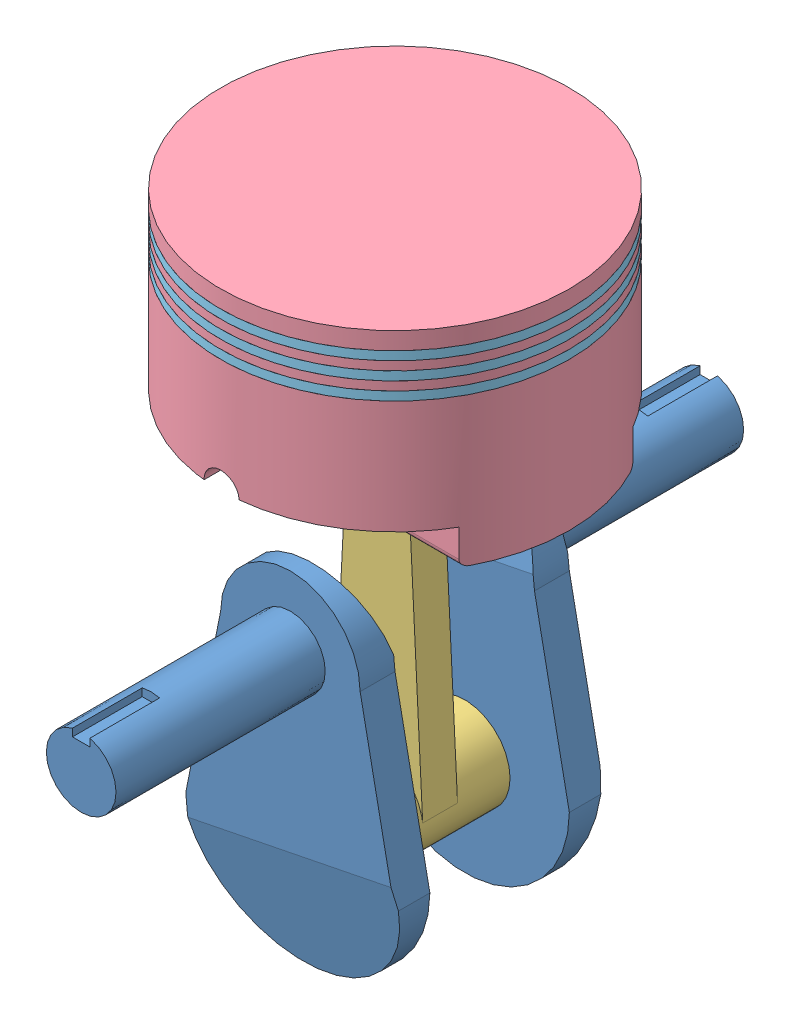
SolidWorks assembly FinalPistonAssembly.SLDASM, configuration Default (file format 13000). Lengths in mm.
Overall size (127 228.6 228.6).
9 component instances, 6 part files, 16 mates.
Components (placement in the parent):
- crank shaft-1-1: crank shaft-1.SLDPRT [Default] at (90.056 100.5786 185.6926) size (76.2 127 228.6)
- HeadPin-1: HeadPin.SLDPRT [Default] at (90.056 227.5786 159.0226) x (1 0 0) z (0 -1 0) size (12.7 53.34 12.7)
- Linkage-1: Linkage.SLDPRT [Default] at (90.056 227.5786 185.6926) size (33.02 153.67 50.8)
- PistonHead-1: PistonHead.SLDPRT [Default] at (90.056 252.9786 153.9426) x (0 0 1) z (-1 0 0) size (127 76.2 127)
- PistonRing-1: PistonRing.SLDPRT [Default] at (90.056 275.2036 185.6926) size (127 3.17 127)
- PistonRing-2: PistonRing.SLDPRT [Default] at (90.056 281.5536 185.6926) size (127 3.17 127)
- PistonRing-3: PistonRing.SLDPRT [Default] at (90.056 268.8536 185.6926) size (127 3.17 127)
- 98808A365_LOW CLEARANCE EXTERNAL RETAINING RING-1: 98808A365_LOW CLEARANCE EXTERNAL RETAINING RING.SLDPRT [98808A365] at (90.056 227.5786 159.8481) x (0 0 1) z (-1 0 0) size (0.89 17.02 17.02)
- 98808A365_LOW CLEARANCE EXTERNAL RETAINING RING-2: 98808A365_LOW CLEARANCE EXTERNAL RETAINING RING.SLDPRT [98808A365] at (90.056 227.5786 211.2831) x (0 0 -1) z (1 0 0) size (0.89 17.02 17.02)
Mates (geometry in assembly coordinates):
- Concentric1: concentric anti-aligned: cylinder of crank shaft-1-1 through (90.056 100.5786 211.0926) axis (0 0 -1) radius 12.7; cylinder of Linkage-1 through (90.056 100.5786 160.2926) axis (0 0 1) radius 12.7
- Coincident1: coincident aligned: plane of crank shaft-1-1 through (90.056 164.0786 160.2926) normal (0 0 1); circle of Linkage-1
- Width1: width anti-aligned: plane of PistonHead-1 through (90.056 111.7033 204.7426) normal (0 0 -1); plane of Linkage-1 through (90.056 111.7033 166.6426) normal (0 0 1); plane of PistonHead-1 through (90.056 227.5786 204.7426) normal (0 0 1); plane of Linkage-1 through (90.056 227.5786 166.6426) normal (0 0 -1)
- Concentric2: concentric aligned: circle of Linkage-1; circle of PistonHead-1
- Concentric3: concentric anti-aligned: cylinder of HeadPin-1 through (90.056 227.5786 212.3626) axis (0 0 -1) radius 6.35; cylinder of Linkage-1 through (90.056 227.5786 166.6426) axis (0 0 1) radius 6.35
- Concentric4: concentric anti-aligned: cylinder of PistonHead-1 through (90.056 214.8786 185.6926) axis (0 -1 0) radius 60.325; cylinder of PistonRing-2 through (90.056 307.0847 185.6926) axis (0 1 0) radius 60.325
- Coincident3: coincident anti-aligned: plane of PistonHead-1 through (90.056 284.7286 122.1926) normal (0 -1 0); plane of PistonRing-2 through (27.9437 284.7286 198.895) normal (0 1 0)
- Concentric5: concentric anti-aligned: cylinder of PistonHead-1 through (90.056 214.8786 185.6926) axis (0 -1 0) radius 60.325; cylinder of PistonRing-1 through (90.056 300.7347 185.6926) axis (0 1 0) radius 60.325
- Coincident4: coincident anti-aligned: plane of PistonHead-1 through (90.056 278.3786 122.1926) normal (0 -1 0); plane of PistonRing-1 through (27.9437 278.3786 198.895) normal (0 1 0)
- Concentric6: concentric anti-aligned: cylinder of PistonHead-1 through (90.056 214.8786 185.6926) axis (0 -1 0) radius 60.325; cylinder of PistonRing-3 through (90.056 294.3847 185.6926) axis (0 1 0) radius 60.325
- Coincident5: coincident anti-aligned: plane of PistonHead-1 through (90.056 272.0286 122.1926) normal (0 -1 0); plane of PistonRing-3 through (27.9437 272.0286 198.895) normal (0 1 0)
- Coincident6: coincident anti-aligned: plane of PistonHead-1 through (90.056 111.7033 160.2926) normal (0 0 -1); plane of 98808A365_LOW CLEARANCE EXTERNAL RETAINING RING-1 through (85.6283 229.3166 160.2926) normal (0 0 1)
- Concentric7: concentric anti-aligned: circle of PistonHead-1; circle of 98808A365_LOW CLEARANCE EXTERNAL RETAINING RING-1
- Coincident7: coincident anti-aligned: plane of PistonHead-1 through (90.056 111.7033 210.8386) normal (0 0 1); plane of 98808A365_LOW CLEARANCE EXTERNAL RETAINING RING-2 through (94.4837 229.3166 210.8386) normal (0 0 -1)
- Concentric8: concentric anti-aligned: circle of HeadPin-1; circle of 98808A365_LOW CLEARANCE EXTERNAL RETAINING RING-2
- Coincident9: coincident aligned: plane of HeadPin-1 through (90.056 227.5786 159.0226) normal (0 0 -1); circle of PistonHead-1
